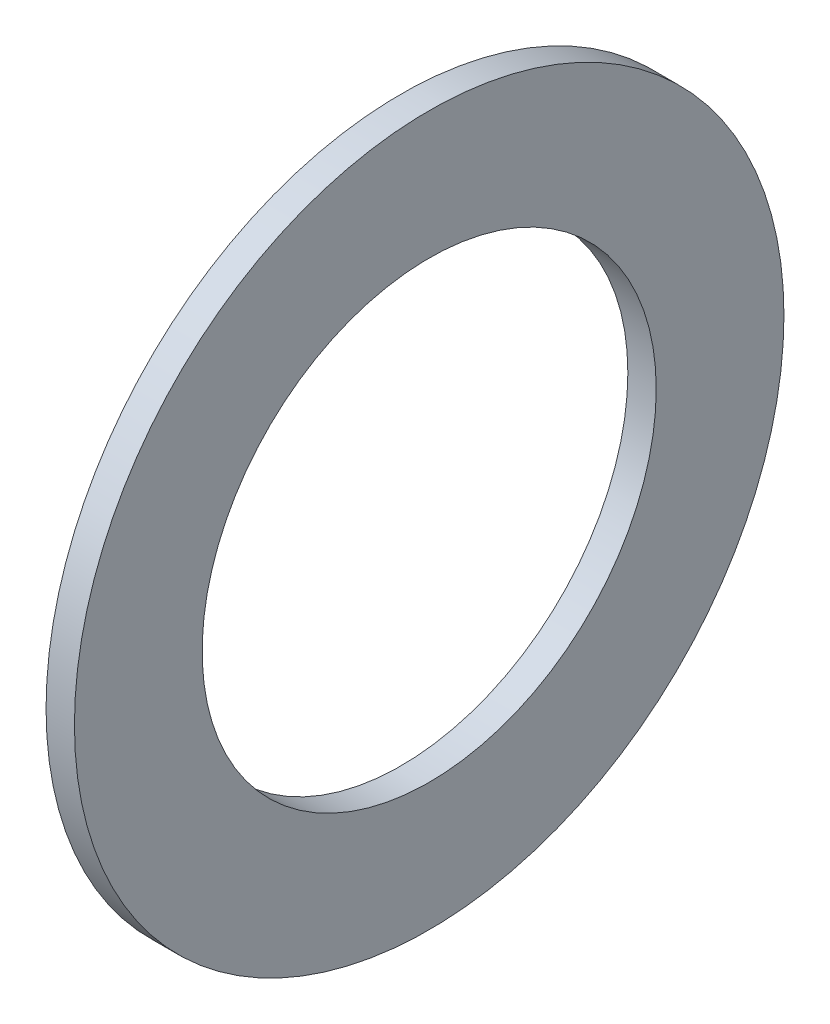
from build123d import *

# Parameters (mm, degrees)
SKETCH1_R           = 2.5
SKETCH1_R_2         = 1.6
BOSS_EXTRUDE1_DEPTH = 0.2


with BuildPart() as part:
    # Sketch1 → Boss-Extrude1 (new body)
    with BuildSketch(Plane(origin=(0, 0, 0), x_dir=(0, 0, -1), z_dir=(1, 0, 0))):
        Circle(SKETCH1_R)
        Circle(SKETCH1_R_2, mode=Mode.SUBTRACT)
    extrude(amount=BOSS_EXTRUDE1_DEPTH)


solid = part.part
